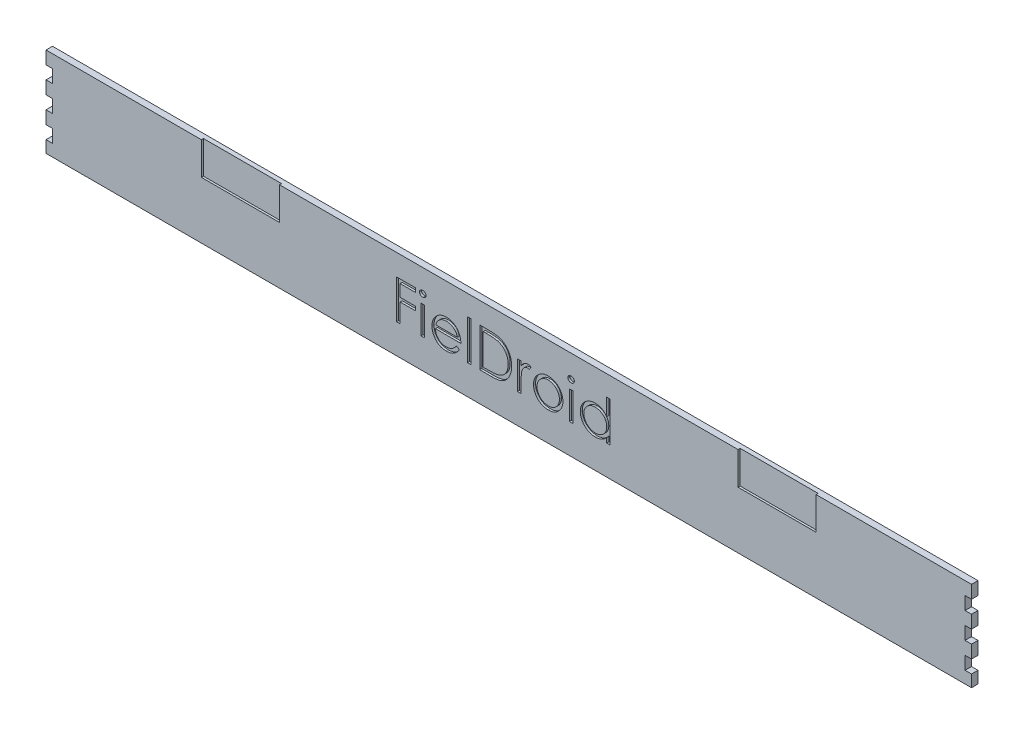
from build123d import *

# Parameters (mm, degrees)
BOSS_EXTRUDE1_DEPTH = 3.175
SKETCH2_W           = 38.354
SKETCH2_H           = 16.002
CUT_EXTRUDE1_DEPTH  = 1.016
SKETCH3_W           = 1.709615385
SKETCH3_H           = 13.921153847
SKETCH3_H_2         = 19.538461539
SKETCH3_W_2         = 1.709615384
CUT_EXTRUDE2_DEPTH  = 1.016


with BuildPart() as part:
    # Sketch1 → Boss-Extrude1 (new body)
    with BuildSketch(Plane.XY):
        Polygon((0, 0), (0, 5.842), (3.175, 5.842), (3.175, 12.192), (0, 12.192), (0, 18.542), (3.175, 18.542), (3.175, 24.892), (0, 24.892), (0, 31.242), (3.175, 31.242), (3.175, 37.592), (0, 37.592), (0, 43.942), (454.025, 43.942), (454.025, 37.592), (450.85, 37.592), (450.85, 31.242), (454.025, 31.242), (454.025, 24.892), (450.85, 24.892), (450.85, 18.542), (454.025, 18.542), (454.025, 12.192), (450.85, 12.192), (450.85, 5.842), (454.025, 5.842), (454.025, 0), align=None)
    extrude(amount=BOSS_EXTRUDE1_DEPTH)

    # Sketch2 → Cut-Extrude1 (cut)
    with BuildSketch(Plane.XY.offset(3.175)):
        with Locations((95.377, 35.941)):
            Rectangle(SKETCH2_W, SKETCH2_H)
        with Locations((358.648, 35.941)):
            Rectangle(SKETCH2_W, SKETCH2_H)
    extrude(amount=-CUT_EXTRUDE1_DEPTH, mode=Mode.SUBTRACT)

    # Sketch3 → Cut-Extrude2 (cut)
    # profile 1 of 11: a face of its own
    with BuildSketch(Plane.XY.offset(3.175)):
        Polygon((171.99724808, 33.521432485), (181.27801731, 33.521432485), (181.27801731, 31.567586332), (173.706863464, 31.567586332), (173.706863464, 25.70604787), (181.27801731, 25.70604787), (181.27801731, 23.752201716), (173.706863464, 23.752201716), (173.706863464, 14.471432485), (171.99724808, 14.471432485), align=None)
    # profile 2 of 11: a face of its own
    with BuildSketch(Plane.XY.offset(3.175)):
        with BuildLine():
            add(Edge.make_bspline(
                [(184.811731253, 34.254124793), (184.9178197, 34.249203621), (185.125561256, 34.23956702), (185.425970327, 34.157045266), (185.699512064, 34.01716555), (185.942142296, 33.829497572), (186.15034185, 33.608792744), (186.296105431, 33.351558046), (186.389790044, 33.073653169), (186.401103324, 32.879805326), (186.406863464, 32.781107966)],
                knots=[0, 0, 0, 0, 1.055194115, 2.066272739, 3.074728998, 4.095836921, 5.109056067, 6.073838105, 7.019297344, 8, 8, 8, 8], degree=3))
            add(Edge.make_bspline(
                [(186.406863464, 32.781107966), (186.400973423, 32.684972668), (186.389329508, 32.494924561), (186.296177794, 32.221837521), (186.149099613, 31.968177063), (185.942275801, 31.747900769), (185.699476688, 31.560336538), (185.425979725, 31.420429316), (185.125558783, 31.337914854), (184.917818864, 31.328277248), (184.811731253, 31.323355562)],
                knots=[0, 0, 0, 0, 0.96129708, 1.900370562, 2.859976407, 3.87933698, 4.906634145, 5.921202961, 6.938410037, 8, 8, 8, 8], degree=3))
            add(Edge.make_bspline(
                [(184.811731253, 31.323355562), (184.706856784, 31.328089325), (184.502732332, 31.337302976), (184.206821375, 31.422048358), (183.935612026, 31.560384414), (183.692508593, 31.74667265), (183.489869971, 31.969529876), (183.342377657, 32.221682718), (183.249441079, 32.494963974), (183.237768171, 32.684985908), (183.231863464, 32.781107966)],
                knots=[0, 0, 0, 0, 1.054934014, 2.053291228, 3.073705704, 4.106921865, 5.123545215, 6.088680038, 7.033164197, 8, 8, 8, 8], degree=3))
            add(Edge.make_bspline(
                [(183.231863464, 32.781107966), (183.237638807, 32.87979159), (183.248981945, 33.073612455), (183.34244732, 33.35171542), (183.488641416, 33.607429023), (183.692642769, 33.830724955), (183.935576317, 34.017117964), (184.206830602, 34.155426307), (184.502729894, 34.240178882), (184.706855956, 34.24939154), (184.811731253, 34.254124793)],
                knots=[0, 0, 0, 0, 0.98631895, 1.937192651, 2.907499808, 3.917963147, 4.944918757, 5.95915025, 6.951458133, 8, 8, 8, 8], degree=3))
        make_face()
    # profile 3 of 11: a face of its own
    with BuildSketch(Plane.XY.offset(3.175)):
        with Locations((184.819363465, 21.432009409)):
            Rectangle(SKETCH3_W, SKETCH3_H)
    # profile 4 of 11: a face of its own
    with BuildSketch(Plane.XY.offset(3.175)):
        with BuildLine():
            Line((201.251514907, 18.867586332), (202.770325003, 18.070020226))
            add(Edge.make_bspline(
                [(202.770325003, 18.070020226), (202.649294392, 17.855335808), (202.413816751, 17.437644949), (202.008864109, 16.863794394), (201.5843644, 16.347551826), (201.12115566, 15.902708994), (200.633096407, 15.514897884), (200.1174801, 15.175602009), (199.571622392, 14.886485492), (198.995497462, 14.642903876), (198.384267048, 14.455617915), (197.736449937, 14.323333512), (197.050805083, 14.241564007), (196.580835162, 14.232065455), (196.340186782, 14.227201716)],
                knots=[0, 0, 0, 0, 1.120438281, 2.179929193, 3.190490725, 4.156257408, 5.095198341, 6.022838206, 6.959905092, 7.901321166, 8.864066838, 9.862729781, 10.905609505, 12, 12, 12, 12], degree=3))
            add(Edge.make_bspline(
                [(196.340186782, 14.227201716), (196.072714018, 14.233445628), (195.550952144, 14.24562569), (194.791457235, 14.350631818), (194.076377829, 14.52193137), (193.405754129, 14.761229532), (192.78122844, 15.073798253), (192.201559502, 15.454577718), (191.66369894, 15.901611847), (191.184595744, 16.418772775), (190.753282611, 16.972213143), (190.372686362, 17.548915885), (190.054510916, 18.147430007), (189.795688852, 18.763945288), (189.586656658, 19.394575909), (189.440969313, 20.045059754), (189.356987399, 20.713636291), (189.34411806, 21.165923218), (189.337632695, 21.393848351)],
                knots=[0, 0, 0, 0, 1.145258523, 2.234067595, 3.276747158, 4.290159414, 5.277019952, 6.260822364, 7.254936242, 8.264827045, 9.274100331, 10.257902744, 11.220704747, 12.172965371, 13.118907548, 14.062713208, 15.023725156, 16, 16, 16, 16], degree=3))
            add(Edge.make_bspline(
                [(189.337632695, 21.393848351), (189.34339745, 21.607724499), (189.354822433, 22.031598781), (189.426835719, 22.658972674), (189.554461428, 23.268727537), (189.729592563, 23.861370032), (189.95575006, 24.435907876), (190.232422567, 24.992690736), (190.560041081, 25.53112614), (190.812985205, 25.870777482), (190.940397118, 26.041865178)],
                knots=[0, 0, 0, 0, 1.024358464, 2.0301432, 3.019427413, 4.004406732, 4.986367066, 5.972626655, 6.978780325, 8, 8, 8, 8], degree=3))
            add(Edge.make_bspline(
                [(190.940397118, 26.041865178), (191.112977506, 26.247980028), (191.452671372, 26.653680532), (192.027199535, 27.186744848), (192.649319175, 27.633297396), (193.311233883, 28.003450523), (194.020636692, 28.284702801), (194.767991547, 28.49429407), (195.561808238, 28.611740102), (196.104489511, 28.628329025), (196.382163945, 28.636817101)],
                knots=[0, 0, 0, 0, 1.030682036, 2.02871468, 2.997146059, 3.962720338, 4.930598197, 5.918074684, 6.934738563, 8, 8, 8, 8], degree=3))
            add(Edge.make_bspline(
                [(196.382163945, 28.636817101), (196.667628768, 28.629447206), (197.227645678, 28.614989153), (198.04424908, 28.480951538), (198.81692098, 28.268394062), (199.545352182, 27.96819986), (200.229616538, 27.580888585), (200.865266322, 27.101145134), (201.463172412, 26.543698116), (201.811017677, 26.115001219), (201.98802332, 25.896853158)],
                knots=[0, 0, 0, 0, 1.056321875, 2.072262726, 3.055038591, 4.01806755, 4.982017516, 5.957941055, 6.960871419, 8, 8, 8, 8], degree=3))
            add(Edge.make_bspline(
                [(201.98802332, 25.896853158), (202.108457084, 25.73245938), (202.34852297, 25.404766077), (202.649225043, 24.870434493), (202.910250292, 24.311395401), (203.118891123, 23.718612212), (203.287834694, 23.099108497), (203.41006395, 22.448455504), (203.481744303, 21.766846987), (203.495834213, 21.302426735), (203.50301731, 21.065663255)],
                knots=[0, 0, 0, 0, 0.94817472, 1.890038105, 2.849395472, 3.817997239, 4.812318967, 5.836947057, 6.897266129, 8, 8, 8, 8], degree=3))
            Line((203.50301731, 21.065663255), (191.04724808, 21.065663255))
            add(Edge.make_bspline(
                [(191.04724808, 21.065663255), (191.055627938, 20.882236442), (191.07210659, 20.521535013), (191.148933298, 19.993736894), (191.270030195, 19.490961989), (191.440223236, 19.016981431), (191.646327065, 18.565604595), (191.898797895, 18.140179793), (192.200003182, 17.742644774), (192.535967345, 17.369443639), (192.90993025, 17.037098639), (193.303354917, 16.739636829), (193.721875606, 16.490323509), (194.162192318, 16.287958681), (194.623593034, 16.129537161), (195.106223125, 16.021399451), (195.609132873, 15.948970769), (195.951955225, 15.940917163), (196.126484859, 15.936817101)],
                knots=[0, 0, 0, 0, 1.094153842, 2.151609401, 3.174256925, 4.172055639, 5.149267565, 6.128595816, 7.11444997, 8.118368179, 9.117203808, 10.09244225, 11.054858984, 12.015122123, 12.976791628, 13.957293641, 14.960065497, 16, 16, 16, 16], degree=3))
            add(Edge.make_bspline(
                [(196.126484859, 15.936817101), (196.297124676, 15.940126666), (196.635706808, 15.946693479), (197.13993776, 16.010548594), (197.635997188, 16.113801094), (198.121831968, 16.254716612), (198.587581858, 16.426584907), (199.018904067, 16.633973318), (199.415580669, 16.863388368), (199.786331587, 17.125786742), (200.145946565, 17.446959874), (200.502684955, 17.847748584), (200.88519074, 18.321753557), (201.124619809, 18.678509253), (201.251514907, 18.867586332)],
                knots=[0, 0, 0, 0, 0.99110716, 1.966546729, 2.947904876, 3.932708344, 4.903319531, 5.828989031, 6.710028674, 7.56322171, 8.463672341, 9.504779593, 10.677557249, 12, 12, 12, 12], degree=3))
        make_face()
        with BuildLine():
            add(Edge.make_bspline(
                [(201.793401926, 22.775278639), (201.730827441, 23.002043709), (201.6103917, 23.438493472), (201.358733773, 24.042873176), (201.075315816, 24.580017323), (200.739917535, 25.04581504), (200.359904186, 25.459491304), (199.920963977, 25.820998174), (199.428734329, 26.144398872), (198.885759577, 26.417371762), (198.310766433, 26.649726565), (197.708752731, 26.80552898), (197.094483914, 26.912260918), (196.679007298, 26.922200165), (196.469934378, 26.927201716)],
                knots=[0, 0, 0, 0, 1.154881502, 2.222775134, 3.210006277, 4.132804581, 5.035138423, 5.962687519, 6.919655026, 7.923214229, 8.944639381, 9.960483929, 10.97369054, 12, 12, 12, 12], degree=3))
            add(Edge.make_bspline(
                [(196.469934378, 26.927201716), (196.299303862, 26.923872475), (195.962003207, 26.917291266), (195.465064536, 26.854860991), (194.98783646, 26.751665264), (194.52679768, 26.610341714), (194.087989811, 26.421972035), (193.662386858, 26.20108333), (193.260810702, 25.931435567), (193.009670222, 25.725919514), (192.882794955, 25.622093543)],
                knots=[0, 0, 0, 0, 1.04873581, 2.073130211, 3.073294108, 4.04793562, 5.032784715, 6.005352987, 6.992311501, 8, 8, 8, 8], degree=3))
            add(Edge.make_bspline(
                [(192.882794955, 25.622093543), (192.791935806, 25.539937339), (192.608059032, 25.373673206), (192.362365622, 25.087219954), (192.127122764, 24.778329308), (191.913035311, 24.435183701), (191.716670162, 24.061690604), (191.532919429, 23.661000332), (191.367530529, 23.230072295), (191.274478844, 22.92977659), (191.226605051, 22.775278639)],
                knots=[0, 0, 0, 0, 0.879870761, 1.780643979, 2.707998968, 3.669668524, 4.684282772, 5.740141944, 6.837334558, 8, 8, 8, 8], degree=3))
            Line((191.226605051, 22.775278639), (201.793401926, 22.775278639))
        make_face(mode=Mode.SUBTRACT)
    # profile 5 of 11: a face of its own
    with BuildSketch(Plane.XY.offset(3.175)):
        with Locations((207.532825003, 24.240663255)):
            Rectangle(SKETCH3_W, SKETCH3_H_2)
    # profile 6 of 11: a face of its own
    with BuildSketch(Plane.XY.offset(3.175)):
        with BuildLine():
            Line((212.783786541, 14.471432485), (212.783786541, 33.521432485))
            Line((212.783786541, 33.521432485), (216.630421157, 33.521432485))
            add(Edge.make_bspline(
                [(216.630421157, 33.521432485), (216.964988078, 33.51902364), (217.611369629, 33.514369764), (218.545431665, 33.484861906), (219.409669, 33.432662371), (220.201239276, 33.356628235), (220.922315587, 33.263266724), (221.570878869, 33.146243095), (222.150282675, 33.00805891), (222.506623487, 32.890245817), (222.675132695, 32.834533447)],
                knots=[0, 0, 0, 0, 1.314313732, 2.53924729, 3.670748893, 4.714932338, 5.66265055, 6.526160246, 7.303039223, 8, 8, 8, 8], degree=3))
            add(Edge.make_bspline(
                [(222.675132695, 32.834533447), (222.895539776, 32.75054632), (223.331355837, 32.584476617), (223.951880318, 32.271205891), (224.536036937, 31.916260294), (225.086958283, 31.519171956), (225.592059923, 31.068697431), (226.071074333, 30.583972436), (226.504405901, 30.047370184), (226.901235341, 29.470019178), (227.259025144, 28.858720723), (227.570025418, 28.214639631), (227.828310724, 27.541046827), (228.042722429, 26.839815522), (228.211703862, 26.109403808), (228.326994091, 25.348961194), (228.403036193, 24.561493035), (228.410678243, 24.027143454), (228.414555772, 23.756017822)],
                knots=[0, 0, 0, 0, 0.984719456, 1.947108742, 2.898477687, 3.838006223, 4.779231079, 5.722358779, 6.681677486, 7.655904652, 8.64651281, 9.637519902, 10.640069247, 11.656948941, 12.698408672, 13.768548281, 14.867775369, 16, 16, 16, 16], degree=3))
            add(Edge.make_bspline(
                [(228.414555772, 23.756017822), (228.411132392, 23.520553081), (228.404386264, 23.056545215), (228.343810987, 22.372699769), (228.255765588, 21.709141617), (228.119453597, 21.069030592), (227.95397706, 20.446758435), (227.741900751, 19.848957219), (227.498956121, 19.270143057), (227.215656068, 18.718142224), (226.904643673, 18.195174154), (226.570878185, 17.702184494), (226.2147156, 17.24620793), (225.832759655, 16.825863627), (225.429946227, 16.441785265), (225.003638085, 16.090764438), (224.552735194, 15.779669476), (224.079257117, 15.496275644), (223.569391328, 15.249059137), (223.013480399, 15.039890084), (222.409153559, 14.866553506), (221.757894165, 14.721931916), (221.058576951, 14.607211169), (220.310516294, 14.530323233), (219.514861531, 14.478327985), (218.968511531, 14.473775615), (218.687302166, 14.471432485)],
                knots=[0, 0, 0, 0, 1.105936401, 2.179363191, 3.223086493, 4.248585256, 5.251745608, 6.245858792, 7.225916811, 8.198733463, 9.158002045, 10.082870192, 10.993790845, 11.873723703, 12.748670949, 13.606408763, 14.465103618, 15.319838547, 16.196477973, 17.123216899, 18.106603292, 19.147568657, 20.255746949, 21.433717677, 22.679120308, 24, 24, 24, 24], degree=3))
            Line((218.687302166, 14.471432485), (212.783786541, 14.471432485))
        make_face()
        with BuildLine():
            Line((214.493401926, 16.425278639), (216.680030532, 16.425278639))
            add(Edge.make_bspline(
                [(216.680030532, 16.425278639), (216.994237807, 16.426628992), (217.598573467, 16.429226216), (218.467569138, 16.452016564), (219.261569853, 16.489256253), (219.980688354, 16.541372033), (220.624518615, 16.610325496), (221.194406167, 16.687205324), (221.688482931, 16.782985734), (221.987456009, 16.869804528), (222.125613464, 16.909924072)],
                knots=[0, 0, 0, 0, 1.375205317, 2.645023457, 3.804390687, 4.853969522, 5.800190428, 6.637939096, 7.370582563, 8, 8, 8, 8], degree=3))
            add(Edge.make_bspline(
                [(222.125613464, 16.909924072), (222.299503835, 16.971164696), (222.643131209, 17.092183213), (223.137783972, 17.312932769), (223.599104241, 17.574418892), (224.035131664, 17.86507984), (224.439681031, 18.195167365), (224.817546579, 18.557503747), (225.167967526, 18.953933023), (225.487323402, 19.38396316), (225.7731186, 19.844917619), (226.020612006, 20.332264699), (226.237518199, 20.840664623), (226.40776311, 21.377924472), (226.541197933, 21.939241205), (226.635711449, 22.524654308), (226.694574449, 23.134054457), (226.70144033, 23.54853959), (226.704940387, 23.759833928)],
                knots=[0, 0, 0, 0, 0.998632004, 1.973411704, 2.929992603, 3.868527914, 4.809262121, 5.754881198, 6.702106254, 7.672490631, 8.653608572, 9.636854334, 10.631411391, 11.644891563, 12.686317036, 13.754757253, 14.855430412, 16, 16, 16, 16], degree=3))
            add(Edge.make_bspline(
                [(226.704940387, 23.759833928), (226.702146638, 23.982629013), (226.696658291, 24.420311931), (226.62767383, 25.06251843), (226.52686365, 25.680177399), (226.381083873, 26.273330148), (226.195314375, 26.843133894), (225.963477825, 27.386437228), (225.698592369, 27.908978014), (225.383432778, 28.398695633), (225.038270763, 28.86184527), (224.65521402, 29.286142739), (224.240348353, 29.672554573), (223.798198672, 30.027098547), (223.316303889, 30.33551084), (222.806015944, 30.611391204), (222.25984879, 30.845520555), (221.87986826, 30.970046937), (221.686761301, 31.033331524)],
                knots=[0, 0, 0, 0, 1.122418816, 2.205001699, 3.251619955, 4.274784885, 5.280384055, 6.268708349, 7.249350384, 8.229342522, 9.199999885, 10.157847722, 11.105861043, 12.055065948, 13.010012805, 13.98527497, 14.976112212, 16, 16, 16, 16], degree=3))
            add(Edge.make_bspline(
                [(221.686761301, 31.033331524), (221.527007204, 31.077508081), (221.187326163, 31.171439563), (220.633028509, 31.273903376), (220.009194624, 31.364279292), (219.313054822, 31.440795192), (218.545402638, 31.495699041), (217.705647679, 31.536908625), (216.793426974, 31.564703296), (216.16106204, 31.56660126), (215.832855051, 31.567586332)],
                knots=[0, 0, 0, 0, 0.674548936, 1.434276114, 2.292660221, 3.240891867, 4.284742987, 5.42552168, 6.663806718, 8, 8, 8, 8], degree=3))
            Line((215.832855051, 31.567586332), (214.493401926, 31.567586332))
            Line((214.493401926, 31.567586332), (214.493401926, 16.425278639))
        make_face(mode=Mode.SUBTRACT)
    # profile 7 of 11: a face of its own
    with BuildSketch(Plane.XY.offset(3.175)):
        with BuildLine():
            Line((231.345325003, 28.392586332), (233.054940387, 28.392586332))
            Line((233.054940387, 28.392586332), (233.054940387, 26.343337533))
            add(Edge.make_bspline(
                [(233.054940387, 26.343337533), (233.181153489, 26.534141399), (233.422535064, 26.899052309), (233.823744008, 27.381666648), (234.234697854, 27.781254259), (234.657363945, 28.099680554), (235.09485046, 28.3381491), (235.537555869, 28.512826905), (235.992445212, 28.616117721), (236.298126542, 28.629908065), (236.451274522, 28.636817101)],
                knots=[0, 0, 0, 0, 1.2804753, 2.448899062, 3.506932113, 4.484331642, 5.4025378, 6.288909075, 7.142734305, 8, 8, 8, 8], degree=3))
            add(Edge.make_bspline(
                [(236.451274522, 28.636817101), (236.570072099, 28.630337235), (236.814505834, 28.617004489), (237.184525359, 28.523328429), (237.565761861, 28.373769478), (237.811465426, 28.233124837), (237.939555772, 28.15980388)],
                knots=[0, 0, 0, 0, 0.901110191, 1.854092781, 2.881294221, 4, 4, 4, 4], degree=3))
            Line((237.939555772, 28.15980388), (237.000793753, 26.679154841))
            add(Edge.make_bspline(
                [(237.000793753, 26.679154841), (236.918557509, 26.715841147), (236.762457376, 26.785478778), (236.534104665, 26.867894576), (236.323567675, 26.916422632), (236.189436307, 26.923774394), (236.126905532, 26.927201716)],
                knots=[0, 0, 0, 0, 1.180555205, 2.24091978, 3.179933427, 4, 4, 4, 4], degree=3))
            add(Edge.make_bspline(
                [(236.126905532, 26.927201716), (235.989714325, 26.918057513), (235.709884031, 26.899405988), (235.299032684, 26.752781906), (234.900358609, 26.515880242), (234.583738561, 26.253147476), (234.338580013, 25.999794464), (234.163645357, 25.778551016), (234.003174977, 25.530473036), (233.849848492, 25.259801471), (233.710150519, 24.961914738), (233.579768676, 24.639788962), (233.46188258, 24.293051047), (233.394661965, 24.051483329), (233.360228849, 23.927742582)],
                knots=[0, 0, 0, 0, 1.125678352, 2.296057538, 3.5422874, 4.923748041, 5.663163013, 6.437101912, 7.23742474, 8.08941207, 8.991984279, 9.93940061, 10.944477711, 12, 12, 12, 12], degree=3))
            add(Edge.make_bspline(
                [(233.360228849, 23.927742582), (233.334471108, 23.817376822), (233.277419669, 23.572925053), (233.221948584, 23.162813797), (233.167141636, 22.67827074), (233.128515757, 22.117947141), (233.092712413, 21.483242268), (233.072518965, 20.773189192), (233.055629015, 19.987059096), (233.055176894, 19.437470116), (233.054940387, 19.149978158)],
                knots=[0, 0, 0, 0, 0.566838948, 1.255505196, 2.06880316, 3.007127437, 4.065329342, 5.249902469, 6.561414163, 8, 8, 8, 8], degree=3))
            Line((233.054940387, 19.149978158), (233.054940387, 14.471432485))
            Line((233.054940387, 14.471432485), (231.345325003, 14.471432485))
            Line((231.345325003, 14.471432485), (231.345325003, 28.392586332))
        make_face()
    # profile 8 of 11: a face of its own
    with BuildSketch(Plane.XY.offset(3.175)):
        with BuildLine():
            add(Edge.make_bspline(
                [(246.373149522, 28.636817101), (246.634359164, 28.631255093), (247.146527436, 28.620349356), (247.896596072, 28.503790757), (248.612577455, 28.325551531), (249.297213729, 28.079144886), (249.941736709, 27.748861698), (250.55553448, 27.354748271), (251.1369242, 26.887845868), (251.485392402, 26.526668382), (251.662272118, 26.343337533)],
                knots=[0, 0, 0, 0, 1.054011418, 2.066658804, 3.057071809, 4.030435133, 4.997543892, 5.974964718, 6.972108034, 8, 8, 8, 8], degree=3))
            add(Edge.make_bspline(
                [(251.662272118, 26.343337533), (251.814573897, 26.168001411), (252.116229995, 25.820722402), (252.50303055, 25.25762828), (252.836250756, 24.674480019), (253.103293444, 24.063533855), (253.313850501, 23.430123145), (253.463342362, 22.77207077), (253.552261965, 22.090829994), (253.5642524, 21.628166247), (253.570325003, 21.393848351)],
                knots=[0, 0, 0, 0, 1.025258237, 2.030674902, 3.01204498, 3.988269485, 4.97094183, 5.956517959, 6.965070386, 8, 8, 8, 8], degree=3))
            add(Edge.make_bspline(
                [(253.570325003, 21.393848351), (253.564983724, 21.158172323), (253.554429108, 20.6924655), (253.454587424, 20.006560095), (253.2992968, 19.341471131), (253.077054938, 18.699983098), (252.792077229, 18.080135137), (252.444329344, 17.48463459), (252.03137097, 16.912306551), (251.563263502, 16.368010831), (251.045909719, 15.866363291), (250.484663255, 15.429147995), (249.890553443, 15.054562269), (249.255680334, 14.752829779), (248.585841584, 14.514924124), (247.879592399, 14.34782832), (247.138029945, 14.246799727), (246.631696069, 14.233826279), (246.373149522, 14.227201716)],
                knots=[0, 0, 0, 0, 0.998656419, 1.973391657, 2.932242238, 3.890759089, 4.846373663, 5.82037756, 6.809684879, 7.83454468, 8.860553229, 9.859544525, 10.845671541, 11.83227036, 12.833544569, 13.85385346, 14.904124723, 16, 16, 16, 16], degree=3))
            add(Edge.make_bspline(
                [(246.373149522, 14.227201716), (246.113336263, 14.233848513), (245.604478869, 14.2468666), (244.860298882, 14.34743581), (244.152783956, 14.514847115), (243.482068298, 14.753611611), (242.844465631, 15.054571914), (242.246913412, 15.428015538), (241.685211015, 15.866492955), (241.167747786, 16.367975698), (240.699669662, 16.912315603), (240.286703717, 17.484632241), (239.938957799, 18.080135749), (239.653979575, 18.699982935), (239.43173785, 19.341471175), (239.276447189, 20.006560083), (239.176605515, 20.692465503), (239.166050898, 21.158172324), (239.160709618, 21.393848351)],
                knots=[0, 0, 0, 0, 1.099876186, 2.154163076, 3.173186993, 4.173200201, 5.163417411, 6.152872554, 7.150605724, 8.17532212, 9.198891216, 10.186952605, 11.159729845, 12.11414092, 13.071450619, 14.029093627, 15.002601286, 16, 16, 16, 16], degree=3))
            add(Edge.make_bspline(
                [(239.160709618, 21.393848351), (239.166823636, 21.626892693), (239.17892834, 22.088280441), (239.26775854, 22.768240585), (239.416667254, 23.425179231), (239.627476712, 24.056145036), (239.896980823, 24.66441391), (240.22551869, 25.249003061), (240.616264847, 25.809550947), (240.916721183, 26.156381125), (241.068762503, 26.331889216)],
                knots=[0, 0, 0, 0, 1.031353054, 2.041901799, 3.029428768, 4.008703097, 4.981709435, 5.96992636, 6.972712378, 8, 8, 8, 8], degree=3))
            add(Edge.make_bspline(
                [(241.068762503, 26.331889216), (241.245375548, 26.516809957), (241.592716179, 26.880489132), (242.176999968, 27.346030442), (242.789287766, 27.748345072), (243.440933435, 28.072065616), (244.125007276, 28.327000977), (244.844657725, 28.504250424), (245.597271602, 28.619929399), (246.111946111, 28.631131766), (246.373149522, 28.636817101)],
                knots=[0, 0, 0, 0, 1.027980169, 2.021703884, 2.998553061, 3.971491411, 4.943284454, 5.930300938, 6.949603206, 8, 8, 8, 8], degree=3))
        make_face()
        with BuildLine():
            add(Edge.make_bspline(
                [(246.36551731, 26.927201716), (246.18079974, 26.921951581), (245.816133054, 26.911586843), (245.279360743, 26.832753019), (244.762615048, 26.707853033), (244.264915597, 26.530393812), (243.787940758, 26.30125552), (243.331233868, 26.019814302), (242.893451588, 25.689797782), (242.483157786, 25.311722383), (242.106608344, 24.898723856), (241.777435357, 24.458677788), (241.497535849, 23.998721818), (241.264362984, 23.51837764), (241.090696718, 23.012777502), (240.964569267, 22.487647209), (240.885809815, 21.94191687), (240.875542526, 21.570926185), (240.870325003, 21.382400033)],
                knots=[0, 0, 0, 0, 1.021534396, 2.016698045, 2.994645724, 3.958388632, 4.93408049, 5.916473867, 6.921342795, 7.962252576, 8.998418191, 10.008913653, 10.997312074, 11.973003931, 12.956656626, 13.948281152, 14.957379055, 16, 16, 16, 16], degree=3))
            add(Edge.make_bspline(
                [(240.870325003, 21.382400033), (240.879070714, 21.138821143), (240.896429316, 20.655362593), (241.037591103, 19.94337634), (241.273736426, 19.259852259), (241.59261862, 18.608797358), (241.992158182, 18.006423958), (242.462894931, 17.469369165), (242.999776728, 17.005714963), (243.596403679, 16.621009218), (244.240589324, 16.31533969), (244.922341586, 16.098719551), (245.633400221, 15.957903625), (246.119342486, 15.943907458), (246.36551731, 15.936817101)],
                knots=[0, 0, 0, 0, 1.016792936, 2.018143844, 3.017858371, 4.030088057, 5.03801393, 6.028138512, 7.003788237, 7.991172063, 8.984598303, 9.972568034, 10.972917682, 12, 12, 12, 12], degree=3))
            add(Edge.make_bspline(
                [(246.36551731, 15.936817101), (246.611677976, 15.943948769), (247.097592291, 15.958026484), (247.807662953, 16.098010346), (248.487551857, 16.316288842), (249.131068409, 16.620665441), (249.72742378, 17.00717587), (250.268166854, 17.466751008), (250.734884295, 18.007846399), (251.13402863, 18.609595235), (251.458133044, 19.258842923), (251.693173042, 19.943502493), (251.834674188, 20.655330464), (251.851986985, 21.138810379), (251.860709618, 21.382400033)],
                knots=[0, 0, 0, 0, 1.02726834, 2.027799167, 3.010890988, 4.004497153, 4.992059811, 5.971914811, 6.958719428, 7.966827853, 8.981595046, 9.981490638, 10.983022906, 12, 12, 12, 12], degree=3))
            add(Edge.make_bspline(
                [(251.860709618, 21.382400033), (251.855493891, 21.570927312), (251.845230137, 21.941920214), (251.766444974, 22.487634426), (251.640412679, 23.012824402), (251.466395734, 23.518204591), (251.23423603, 23.999965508), (250.948938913, 24.457327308), (250.621110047, 24.900248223), (250.24001686, 25.310387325), (249.830151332, 25.689945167), (249.392191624, 26.019942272), (248.936161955, 26.300018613), (248.460572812, 26.532353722), (247.962809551, 26.706238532), (247.446787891, 26.833474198), (246.912305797, 26.911253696), (246.548945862, 26.921851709), (246.36551731, 26.927201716)],
                knots=[0, 0, 0, 0, 1.042956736, 2.052379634, 3.044323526, 4.02829302, 5.004299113, 5.996692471, 7.007513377, 8.048758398, 9.090003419, 10.095195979, 11.07790575, 12.047570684, 13.018257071, 13.989683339, 14.985167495, 16, 16, 16, 16], degree=3))
        make_face(mode=Mode.SUBTRACT)
    # profile 9 of 11: a face of its own
    with BuildSketch(Plane.XY.offset(3.175)):
        with BuildLine():
            add(Edge.make_bspline(
                [(257.592500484, 34.254124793), (257.698588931, 34.249203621), (257.906330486, 34.23956702), (258.206739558, 34.157045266), (258.480281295, 34.01716555), (258.722911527, 33.829497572), (258.931111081, 33.608792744), (259.076874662, 33.351558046), (259.170559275, 33.073653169), (259.181872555, 32.879805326), (259.187632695, 32.781107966)],
                knots=[0, 0, 0, 0, 1.055194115, 2.066272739, 3.074728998, 4.095836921, 5.109056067, 6.073838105, 7.019297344, 8, 8, 8, 8], degree=3))
            add(Edge.make_bspline(
                [(259.187632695, 32.781107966), (259.181742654, 32.684972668), (259.170098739, 32.494924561), (259.076947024, 32.221837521), (258.929868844, 31.968177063), (258.723045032, 31.747900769), (258.480245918, 31.560336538), (258.206748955, 31.420429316), (257.906328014, 31.337914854), (257.698588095, 31.328277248), (257.592500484, 31.323355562)],
                knots=[0, 0, 0, 0, 0.96129708, 1.900370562, 2.859976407, 3.87933698, 4.906634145, 5.921202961, 6.938410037, 8, 8, 8, 8], degree=3))
            add(Edge.make_bspline(
                [(257.592500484, 31.323355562), (257.487626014, 31.328089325), (257.283501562, 31.337302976), (256.987590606, 31.422048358), (256.716381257, 31.560384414), (256.473277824, 31.74667265), (256.270639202, 31.969529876), (256.123146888, 32.221682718), (256.030210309, 32.494963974), (256.018537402, 32.684985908), (256.012632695, 32.781107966)],
                knots=[0, 0, 0, 0, 1.054934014, 2.053291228, 3.073705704, 4.106921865, 5.123545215, 6.088680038, 7.033164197, 8, 8, 8, 8], degree=3))
            add(Edge.make_bspline(
                [(256.012632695, 32.781107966), (256.018408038, 32.87979159), (256.029751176, 33.073612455), (256.123216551, 33.35171542), (256.269410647, 33.607429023), (256.473412, 33.830724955), (256.716345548, 34.017117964), (256.987599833, 34.155426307), (257.283499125, 34.240178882), (257.487625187, 34.24939154), (257.592500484, 34.254124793)],
                knots=[0, 0, 0, 0, 0.98631895, 1.937192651, 2.907499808, 3.917963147, 4.944918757, 5.95915025, 6.951458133, 8, 8, 8, 8], degree=3))
        make_face()
    # profile 10 of 11: a face of its own
    with BuildSketch(Plane.XY.offset(3.175)):
        with Locations((257.600132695, 21.432009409)):
            Rectangle(SKETCH3_W_2, SKETCH3_H)
    # profile 11 of 11: a face of its own
    with BuildSketch(Plane.XY.offset(3.175)):
        with BuildLine():
            Line((276.77224808, 34.009894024), (276.77224808, 14.471432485))
            Line((276.77224808, 14.471432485), (275.062632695, 14.471432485))
            Line((275.062632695, 14.471432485), (275.062632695, 16.879395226))
            add(Edge.make_bspline(
                [(275.062632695, 16.879395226), (274.869853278, 16.661465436), (274.49364182, 16.23617271), (273.865312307, 15.680554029), (273.199279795, 15.221294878), (272.49877689, 14.850364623), (271.764436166, 14.571733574), (270.997885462, 14.373688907), (270.198812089, 14.246359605), (269.653152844, 14.233644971), (269.376635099, 14.227201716)],
                knots=[0, 0, 0, 0, 1.074387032, 2.096679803, 3.090159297, 4.057316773, 5.018401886, 5.985159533, 6.978961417, 8, 8, 8, 8], degree=3))
            add(Edge.make_bspline(
                [(269.376635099, 14.227201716), (269.130792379, 14.233876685), (268.645979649, 14.24704002), (267.932807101, 14.349160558), (267.246505, 14.513157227), (266.586424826, 14.741217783), (265.956837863, 15.043736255), (265.352353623, 15.405910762), (264.776103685, 15.83720728), (264.236871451, 16.330264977), (263.740308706, 16.865814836), (263.304546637, 17.437018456), (262.941219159, 18.041405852), (262.637398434, 18.671324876), (262.403375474, 19.331624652), (262.240233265, 20.020021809), (262.13823169, 20.735702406), (262.125073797, 21.223053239), (262.118401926, 21.470170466)],
                knots=[0, 0, 0, 0, 1.033919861, 2.038935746, 3.024066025, 3.998881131, 4.97069526, 5.957263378, 6.95902576, 7.993208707, 9.027059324, 10.027763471, 11.009749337, 11.988697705, 12.965288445, 13.950418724, 14.960734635, 16, 16, 16, 16], degree=3))
            add(Edge.make_bspline(
                [(262.118401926, 21.470170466), (262.12522167, 21.712180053), (262.138703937, 22.19061995), (262.239142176, 22.894265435), (262.408039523, 23.57200054), (262.645064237, 24.22164333), (262.94900402, 24.843979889), (263.318726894, 25.439450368), (263.754259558, 26.009695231), (264.256376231, 26.541305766), (264.800306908, 27.032363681), (265.382195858, 27.459132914), (265.987568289, 27.827706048), (266.625814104, 28.119734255), (267.287486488, 28.35600381), (267.978475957, 28.519468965), (268.69590755, 28.615792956), (269.182991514, 28.629741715), (269.43006058, 28.636817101)],
                knots=[0, 0, 0, 0, 1.020392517, 2.01726096, 2.990465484, 3.961182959, 4.928053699, 5.906110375, 6.912531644, 7.948652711, 8.985773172, 9.998621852, 10.987621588, 11.969261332, 12.953316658, 13.946091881, 14.958173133, 16, 16, 16, 16], degree=3))
            add(Edge.make_bspline(
                [(269.43006058, 28.636817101), (269.714269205, 28.628287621), (270.272139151, 28.6115452), (271.088015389, 28.471629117), (271.859745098, 28.236699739), (272.591771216, 27.915074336), (273.279729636, 27.497058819), (273.928663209, 26.992225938), (274.527286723, 26.386288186), (274.881463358, 25.931202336), (275.062632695, 25.698415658)],
                knots=[0, 0, 0, 0, 1.031072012, 2.023879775, 2.993683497, 3.952812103, 4.918022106, 5.908088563, 6.929940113, 8, 8, 8, 8], degree=3))
            Line((275.062632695, 25.698415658), (275.062632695, 34.009894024))
            Line((275.062632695, 34.009894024), (276.77224808, 34.009894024))
        make_face()
        with BuildLine():
            add(Edge.make_bspline(
                [(269.452957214, 26.927201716), (269.203052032, 26.918310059), (268.709778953, 26.900759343), (267.985639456, 26.763743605), (267.29269073, 26.535771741), (266.634398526, 26.223994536), (266.021161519, 25.831952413), (265.473100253, 25.35776317), (264.985732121, 24.814364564), (264.575839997, 24.204208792), (264.241700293, 23.55009661), (264.006748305, 22.86634074), (263.851794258, 22.165273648), (263.835963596, 21.68977103), (263.82801731, 21.451089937)],
                knots=[0, 0, 0, 0, 1.031046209, 2.035121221, 3.029706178, 4.034933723, 5.034054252, 6.02443088, 7.017295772, 8.038157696, 9.050218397, 10.03989886, 11.016116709, 12, 12, 12, 12], degree=3))
            add(Edge.make_bspline(
                [(263.82801731, 21.451089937), (263.838167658, 21.213835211), (263.858428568, 20.740255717), (264.004028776, 20.038232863), (264.248303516, 19.354315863), (264.581635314, 18.694309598), (264.999029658, 18.081530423), (265.482837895, 17.527773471), (266.037738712, 17.05158014), (266.652387, 16.65295849), (267.308838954, 16.33094534), (267.999177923, 16.106886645), (268.710426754, 15.962227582), (269.194037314, 15.945330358), (269.437692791, 15.936817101)],
                knots=[0, 0, 0, 0, 0.979072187, 1.954306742, 2.945804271, 3.96968567, 4.997920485, 5.998718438, 6.996577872, 8.005894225, 9.015743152, 10.005417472, 10.995077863, 12, 12, 12, 12], degree=3))
            add(Edge.make_bspline(
                [(269.437692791, 15.936817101), (269.685051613, 15.945852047), (270.177023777, 15.96382166), (270.903311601, 16.101423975), (271.608134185, 16.328765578), (272.281890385, 16.643902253), (272.909539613, 17.03446729), (273.472863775, 17.491705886), (273.949200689, 18.023490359), (274.353020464, 18.607925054), (274.669660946, 19.248614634), (274.900307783, 19.93079073), (275.036672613, 20.654477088), (275.053859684, 21.149036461), (275.062632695, 21.401480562)],
                knots=[0, 0, 0, 0, 1.01762866, 2.023962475, 3.030623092, 4.058876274, 5.077231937, 6.066672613, 7.034107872, 8.005628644, 8.981990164, 9.965428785, 10.961468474, 12, 12, 12, 12], degree=3))
            add(Edge.make_bspline(
                [(275.062632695, 21.401480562), (275.057409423, 21.593819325), (275.047128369, 21.972402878), (274.968584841, 22.528268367), (274.843644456, 23.060219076), (274.667588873, 23.568814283), (274.436314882, 24.05124201), (274.157380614, 24.510966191), (273.825880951, 24.945595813), (273.447152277, 25.349145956), (273.03259596, 25.717227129), (272.593931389, 26.045781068), (272.125961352, 26.315685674), (271.636555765, 26.539067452), (271.124865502, 26.716826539), (270.586726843, 26.835413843), (270.027859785, 26.916840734), (269.646609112, 26.923711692), (269.452957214, 26.927201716)],
                knots=[0, 0, 0, 0, 1.050140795, 2.067009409, 3.05949893, 4.030605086, 5.00011959, 5.97591094, 6.962425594, 7.979863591, 8.993523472, 9.986985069, 10.967611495, 11.937549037, 12.921786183, 13.919465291, 14.943216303, 16, 16, 16, 16], degree=3))
        make_face(mode=Mode.SUBTRACT)
    extrude(amount=-CUT_EXTRUDE2_DEPTH, mode=Mode.SUBTRACT)


solid = part.part
